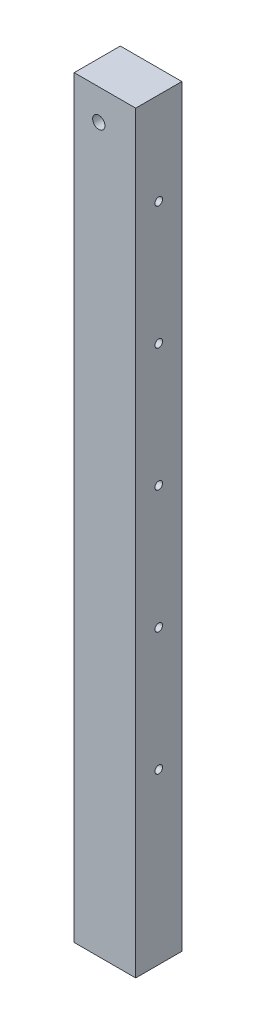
ISO-10303-21;
HEADER;
FILE_DESCRIPTION(('STEP AP214'),'2;1');
FILE_NAME('part.step','',(''),(''),'','','');
FILE_SCHEMA(('AUTOMOTIVE_DESIGN { 1 0 10303 214 1 1 1 1 }'));
ENDSEC;
DATA;
#1=APPLICATION_CONTEXT('core data for automotive mechanical design processes');
#2=APPLICATION_PROTOCOL_DEFINITION('international standard','automotive_design',2000,#1);
#3=PRODUCT_CONTEXT('',#1,'mechanical');
#4=PRODUCT('Part','Part','',(#3));
#5=PRODUCT_RELATED_PRODUCT_CATEGORY('part','',(#4));
#6=PRODUCT_DEFINITION_FORMATION('','',#4);
#7=PRODUCT_DEFINITION_CONTEXT('part definition',#1,'design');
#8=PRODUCT_DEFINITION('design','',#6,#7);
#9=PRODUCT_DEFINITION_SHAPE('','',#8);
#10=(LENGTH_UNIT() NAMED_UNIT(*) SI_UNIT(.MILLI.,.METRE.));
#11=(NAMED_UNIT(*) PLANE_ANGLE_UNIT() SI_UNIT($,.RADIAN.));
#12=(NAMED_UNIT(*) SI_UNIT($,.STERADIAN.) SOLID_ANGLE_UNIT());
#13=UNCERTAINTY_MEASURE_WITH_UNIT(LENGTH_MEASURE(1.E-05),#10,'distance_accuracy_value','');
#14=(GEOMETRIC_REPRESENTATION_CONTEXT(3) GLOBAL_UNCERTAINTY_ASSIGNED_CONTEXT((#13)) GLOBAL_UNIT_ASSIGNED_CONTEXT((#10,
#11,#12)) REPRESENTATION_CONTEXT('',''));
#15=CARTESIAN_POINT('',(0.,0.,0.));
#16=DIRECTION('',(0.,0.,1.));
#17=DIRECTION('',(1.,0.,0.));
#18=AXIS2_PLACEMENT_3D('',#15,#16,#17);
#19=CARTESIAN_POINT('',(0.,245.,0.));
#20=DIRECTION('',(1.,0.,0.));
#21=DIRECTION('',(0.,0.,-1.));
#22=AXIS2_PLACEMENT_3D('',#19,#20,#21);
#23=PLANE('',#22);
#24=CARTESIAN_POINT('',(0.,55.0000000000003,-7.49999999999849));
#25=DIRECTION('',(-1.,0.,0.));
#26=DIRECTION('',(0.,0.,1.));
#27=AXIS2_PLACEMENT_3D('',#24,#25,#26);
#28=CIRCLE('',#27,1.24999999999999);
#29=CARTESIAN_POINT('',(0.,55.0000000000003,-6.24999999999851));
#30=VERTEX_POINT('',#29);
#31=EDGE_CURVE('E136',#30,#30,#28,.T.);
#32=ORIENTED_EDGE('',*,*,#31,.F.);
#33=EDGE_LOOP('',(#32));
#34=FACE_BOUND('',#33,.T.);
#35=CARTESIAN_POINT('',(0.,95.0000000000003,-7.49999999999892));
#36=DIRECTION('',(-1.,0.,0.));
#37=DIRECTION('',(0.,0.,1.));
#38=AXIS2_PLACEMENT_3D('',#35,#36,#37);
#39=CIRCLE('',#38,1.24999999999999);
#40=CARTESIAN_POINT('',(0.,95.0000000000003,-6.24999999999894));
#41=VERTEX_POINT('',#40);
#42=EDGE_CURVE('E130',#41,#41,#39,.T.);
#43=ORIENTED_EDGE('',*,*,#42,.F.);
#44=EDGE_LOOP('',(#43));
#45=FACE_BOUND('',#44,.T.);
#46=CARTESIAN_POINT('',(0.,135.,-7.49999999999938));
#47=DIRECTION('',(-1.,0.,0.));
#48=DIRECTION('',(0.,0.,1.));
#49=AXIS2_PLACEMENT_3D('',#46,#47,#48);
#50=CIRCLE('',#49,1.25);
#51=CARTESIAN_POINT('',(0.,135.,-6.24999999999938));
#52=VERTEX_POINT('',#51);
#53=EDGE_CURVE('E124',#52,#52,#50,.T.);
#54=ORIENTED_EDGE('',*,*,#53,.F.);
#55=EDGE_LOOP('',(#54));
#56=FACE_BOUND('',#55,.T.);
#57=CARTESIAN_POINT('',(0.,175.,-7.49999999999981));
#58=DIRECTION('',(-1.,0.,0.));
#59=DIRECTION('',(0.,0.,1.));
#60=AXIS2_PLACEMENT_3D('',#57,#58,#59);
#61=CIRCLE('',#60,1.25);
#62=CARTESIAN_POINT('',(0.,175.,-6.24999999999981));
#63=VERTEX_POINT('',#62);
#64=EDGE_CURVE('E118',#63,#63,#61,.T.);
#65=ORIENTED_EDGE('',*,*,#64,.F.);
#66=EDGE_LOOP('',(#65));
#67=FACE_BOUND('',#66,.T.);
#68=CARTESIAN_POINT('',(0.,215.,-7.50000000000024));
#69=DIRECTION('',(-1.,0.,0.));
#70=DIRECTION('',(0.,0.,1.));
#71=AXIS2_PLACEMENT_3D('',#68,#69,#70);
#72=CIRCLE('',#71,1.24999999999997);
#73=CARTESIAN_POINT('',(0.,215.,-6.25000000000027));
#74=VERTEX_POINT('',#73);
#75=EDGE_CURVE('E112',#74,#74,#72,.T.);
#76=ORIENTED_EDGE('',*,*,#75,.F.);
#77=EDGE_LOOP('',(#76));
#78=FACE_BOUND('',#77,.T.);
#79=DIRECTION('',(0.,0.,1.));
#80=VECTOR('',#79,1.);
#81=CARTESIAN_POINT('',(0.,0.,0.));
#82=LINE('',#81,#80);
#83=CARTESIAN_POINT('',(0.,0.,-15.));
#84=VERTEX_POINT('',#83);
#85=CARTESIAN_POINT('',(0.,0.,0.));
#86=VERTEX_POINT('',#85);
#87=EDGE_CURVE('E96',#84,#86,#82,.T.);
#88=ORIENTED_EDGE('',*,*,#87,.T.);
#89=DIRECTION('',(0.,-1.,0.));
#90=VECTOR('',#89,1.);
#91=CARTESIAN_POINT('',(0.,245.,0.));
#92=LINE('',#91,#90);
#93=CARTESIAN_POINT('',(0.,245.,0.));
#94=VERTEX_POINT('',#93);
#95=EDGE_CURVE('E11',#94,#86,#92,.T.);
#96=ORIENTED_EDGE('',*,*,#95,.F.);
#97=DIRECTION('',(0.,0.,1.));
#98=VECTOR('',#97,1.);
#99=CARTESIAN_POINT('',(0.,245.,0.));
#100=LINE('',#99,#98);
#101=CARTESIAN_POINT('',(0.,245.,-15.));
#102=VERTEX_POINT('',#101);
#103=EDGE_CURVE('E84',#102,#94,#100,.T.);
#104=ORIENTED_EDGE('',*,*,#103,.F.);
#105=DIRECTION('',(0.,-1.,0.));
#106=VECTOR('',#105,1.);
#107=CARTESIAN_POINT('',(0.,245.,-15.));
#108=LINE('',#107,#106);
#109=EDGE_CURVE('E92',#102,#84,#108,.T.);
#110=ORIENTED_EDGE('',*,*,#109,.T.);
#111=EDGE_LOOP('',(#88,#96,#104,#110));
#112=FACE_BOUND('',#111,.T.);
#113=ADVANCED_FACE('F33',(#34,#45,#56,#67,#78,#112),#23,.F.);
#114=CARTESIAN_POINT('',(0.,245.,0.));
#115=DIRECTION('',(0.,0.,-1.));
#116=DIRECTION('',(-1.,0.,0.));
#117=AXIS2_PLACEMENT_3D('',#114,#115,#116);
#118=PLANE('',#117);
#119=CARTESIAN_POINT('',(7.9999999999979,235.,0.));
#120=DIRECTION('',(0.,0.,1.));
#121=DIRECTION('',(1.,0.,0.));
#122=AXIS2_PLACEMENT_3D('',#119,#120,#121);
#123=CIRCLE('',#122,1.99999999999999);
#124=CARTESIAN_POINT('',(9.99999999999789,235.,0.));
#125=VERTEX_POINT('',#124);
#126=EDGE_CURVE('E142',#125,#125,#123,.T.);
#127=ORIENTED_EDGE('',*,*,#126,.F.);
#128=EDGE_LOOP('',(#127));
#129=FACE_BOUND('',#128,.T.);
#130=DIRECTION('',(1.,0.,0.));
#131=VECTOR('',#130,1.);
#132=CARTESIAN_POINT('',(0.,0.,0.));
#133=LINE('',#132,#131);
#134=CARTESIAN_POINT('',(20.,0.,0.));
#135=VERTEX_POINT('',#134);
#136=EDGE_CURVE('E88',#86,#135,#133,.T.);
#137=ORIENTED_EDGE('',*,*,#136,.T.);
#138=DIRECTION('',(0.,-1.,0.));
#139=VECTOR('',#138,1.);
#140=CARTESIAN_POINT('',(20.,245.,0.));
#141=LINE('',#140,#139);
#142=CARTESIAN_POINT('',(20.,245.,0.));
#143=VERTEX_POINT('',#142);
#144=EDGE_CURVE('E41',#143,#135,#141,.T.);
#145=ORIENTED_EDGE('',*,*,#144,.F.);
#146=DIRECTION('',(1.,0.,0.));
#147=VECTOR('',#146,1.);
#148=CARTESIAN_POINT('',(0.,245.,0.));
#149=LINE('',#148,#147);
#150=EDGE_CURVE('E79',#94,#143,#149,.T.);
#151=ORIENTED_EDGE('',*,*,#150,.F.);
#152=ORIENTED_EDGE('',*,*,#95,.T.);
#153=EDGE_LOOP('',(#137,#145,#151,#152));
#154=FACE_BOUND('',#153,.T.);
#155=ADVANCED_FACE('F87',(#129,#154),#118,.F.);
#156=CARTESIAN_POINT('',(20.,245.,0.));
#157=DIRECTION('',(-1.,0.,0.));
#158=DIRECTION('',(0.,0.,1.));
#159=AXIS2_PLACEMENT_3D('',#156,#157,#158);
#160=PLANE('',#159);
#161=CARTESIAN_POINT('',(20.,55.0000000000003,-7.49999999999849));
#162=DIRECTION('',(-1.,0.,0.));
#163=DIRECTION('',(0.,0.,1.));
#164=AXIS2_PLACEMENT_3D('',#161,#162,#163);
#165=CIRCLE('',#164,1.24999999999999);
#166=CARTESIAN_POINT('',(20.,55.0000000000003,-6.2499999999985));
#167=VERTEX_POINT('',#166);
#168=EDGE_CURVE('E133',#167,#167,#165,.T.);
#169=ORIENTED_EDGE('',*,*,#168,.T.);
#170=EDGE_LOOP('',(#169));
#171=FACE_BOUND('',#170,.T.);
#172=CARTESIAN_POINT('',(20.,95.0000000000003,-7.49999999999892));
#173=DIRECTION('',(-1.,0.,0.));
#174=DIRECTION('',(0.,0.,1.));
#175=AXIS2_PLACEMENT_3D('',#172,#173,#174);
#176=CIRCLE('',#175,1.25);
#177=CARTESIAN_POINT('',(20.,95.0000000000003,-6.24999999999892));
#178=VERTEX_POINT('',#177);
#179=EDGE_CURVE('E127',#178,#178,#176,.T.);
#180=ORIENTED_EDGE('',*,*,#179,.T.);
#181=EDGE_LOOP('',(#180));
#182=FACE_BOUND('',#181,.T.);
#183=CARTESIAN_POINT('',(20.,135.,-7.49999999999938));
#184=DIRECTION('',(-1.,0.,0.));
#185=DIRECTION('',(0.,0.,1.));
#186=AXIS2_PLACEMENT_3D('',#183,#184,#185);
#187=CIRCLE('',#186,1.25);
#188=CARTESIAN_POINT('',(20.,135.,-6.24999999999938));
#189=VERTEX_POINT('',#188);
#190=EDGE_CURVE('E121',#189,#189,#187,.T.);
#191=ORIENTED_EDGE('',*,*,#190,.T.);
#192=EDGE_LOOP('',(#191));
#193=FACE_BOUND('',#192,.T.);
#194=CARTESIAN_POINT('',(20.,175.,-7.49999999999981));
#195=DIRECTION('',(-1.,0.,0.));
#196=DIRECTION('',(0.,0.,1.));
#197=AXIS2_PLACEMENT_3D('',#194,#195,#196);
#198=CIRCLE('',#197,1.25);
#199=CARTESIAN_POINT('',(20.,175.,-6.24999999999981));
#200=VERTEX_POINT('',#199);
#201=EDGE_CURVE('E115',#200,#200,#198,.T.);
#202=ORIENTED_EDGE('',*,*,#201,.T.);
#203=EDGE_LOOP('',(#202));
#204=FACE_BOUND('',#203,.T.);
#205=CARTESIAN_POINT('',(20.,215.,-7.50000000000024));
#206=DIRECTION('',(-1.,0.,0.));
#207=DIRECTION('',(0.,0.,1.));
#208=AXIS2_PLACEMENT_3D('',#205,#206,#207);
#209=CIRCLE('',#208,1.25);
#210=CARTESIAN_POINT('',(20.,215.,-6.25000000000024));
#211=VERTEX_POINT('',#210);
#212=EDGE_CURVE('E99',#211,#211,#209,.T.);
#213=ORIENTED_EDGE('',*,*,#212,.T.);
#214=EDGE_LOOP('',(#213));
#215=FACE_BOUND('',#214,.T.);
#216=DIRECTION('',(0.,0.,-1.));
#217=VECTOR('',#216,1.);
#218=CARTESIAN_POINT('',(20.,0.,0.));
#219=LINE('',#218,#217);
#220=CARTESIAN_POINT('',(20.,0.,-15.));
#221=VERTEX_POINT('',#220);
#222=EDGE_CURVE('E66',#135,#221,#219,.T.);
#223=ORIENTED_EDGE('',*,*,#222,.T.);
#224=DIRECTION('',(0.,-1.,0.));
#225=VECTOR('',#224,1.);
#226=CARTESIAN_POINT('',(20.,245.,-15.));
#227=LINE('',#226,#225);
#228=CARTESIAN_POINT('',(20.,245.,-15.));
#229=VERTEX_POINT('',#228);
#230=EDGE_CURVE('E89',#229,#221,#227,.T.);
#231=ORIENTED_EDGE('',*,*,#230,.F.);
#232=DIRECTION('',(0.,0.,-1.));
#233=VECTOR('',#232,1.);
#234=CARTESIAN_POINT('',(20.,245.,0.));
#235=LINE('',#234,#233);
#236=EDGE_CURVE('E82',#143,#229,#235,.T.);
#237=ORIENTED_EDGE('',*,*,#236,.F.);
#238=ORIENTED_EDGE('',*,*,#144,.T.);
#239=EDGE_LOOP('',(#223,#231,#237,#238));
#240=FACE_BOUND('',#239,.T.);
#241=ADVANCED_FACE('F90',(#171,#182,#193,#204,#215,#240),#160,.F.);
#242=CARTESIAN_POINT('',(0.,245.,-15.));
#243=DIRECTION('',(0.,0.,1.));
#244=DIRECTION('',(1.,0.,0.));
#245=AXIS2_PLACEMENT_3D('',#242,#243,#244);
#246=PLANE('',#245);
#247=CARTESIAN_POINT('',(7.9999999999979,235.,-15.));
#248=DIRECTION('',(0.,0.,1.));
#249=DIRECTION('',(1.,0.,0.));
#250=AXIS2_PLACEMENT_3D('',#247,#248,#249);
#251=CIRCLE('',#250,2.);
#252=CARTESIAN_POINT('',(9.9999999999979,235.,-15.));
#253=VERTEX_POINT('',#252);
#254=EDGE_CURVE('E139',#253,#253,#251,.T.);
#255=ORIENTED_EDGE('',*,*,#254,.T.);
#256=EDGE_LOOP('',(#255));
#257=FACE_BOUND('',#256,.T.);
#258=DIRECTION('',(-1.,0.,0.));
#259=VECTOR('',#258,1.);
#260=CARTESIAN_POINT('',(0.,0.,-15.));
#261=LINE('',#260,#259);
#262=EDGE_CURVE('E72',#221,#84,#261,.T.);
#263=ORIENTED_EDGE('',*,*,#262,.T.);
#264=ORIENTED_EDGE('',*,*,#109,.F.);
#265=DIRECTION('',(-1.,0.,0.));
#266=VECTOR('',#265,1.);
#267=CARTESIAN_POINT('',(0.,245.,-15.));
#268=LINE('',#267,#266);
#269=EDGE_CURVE('E49',#229,#102,#268,.T.);
#270=ORIENTED_EDGE('',*,*,#269,.F.);
#271=ORIENTED_EDGE('',*,*,#230,.T.);
#272=EDGE_LOOP('',(#263,#264,#270,#271));
#273=FACE_BOUND('',#272,.T.);
#274=ADVANCED_FACE('F104',(#257,#273),#246,.F.);
#275=CARTESIAN_POINT('',(0.,245.,0.));
#276=DIRECTION('',(0.,-1.,0.));
#277=DIRECTION('',(0.,0.,-1.));
#278=AXIS2_PLACEMENT_3D('',#275,#276,#277);
#279=PLANE('',#278);
#280=ORIENTED_EDGE('',*,*,#103,.T.);
#281=ORIENTED_EDGE('',*,*,#150,.T.);
#282=ORIENTED_EDGE('',*,*,#236,.T.);
#283=ORIENTED_EDGE('',*,*,#269,.T.);
#284=EDGE_LOOP('',(#280,#281,#282,#283));
#285=FACE_BOUND('',#284,.T.);
#286=ADVANCED_FACE('F80',(#285),#279,.F.);
#287=CARTESIAN_POINT('',(0.,0.,0.));
#288=DIRECTION('',(0.,-1.,0.));
#289=DIRECTION('',(0.,0.,-1.));
#290=AXIS2_PLACEMENT_3D('',#287,#288,#289);
#291=PLANE('',#290);
#292=ORIENTED_EDGE('',*,*,#87,.F.);
#293=ORIENTED_EDGE('',*,*,#262,.F.);
#294=ORIENTED_EDGE('',*,*,#222,.F.);
#295=ORIENTED_EDGE('',*,*,#136,.F.);
#296=EDGE_LOOP('',(#292,#293,#294,#295));
#297=FACE_BOUND('',#296,.T.);
#298=ADVANCED_FACE('F107',(#297),#291,.T.);
#299=CARTESIAN_POINT('',(0.,215.,-7.50000000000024));
#300=DIRECTION('',(-1.,0.,0.));
#301=DIRECTION('',(0.,0.,1.));
#302=AXIS2_PLACEMENT_3D('',#299,#300,#301);
#303=CYLINDRICAL_SURFACE('',#302,1.24999999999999);
#304=ORIENTED_EDGE('',*,*,#212,.F.);
#305=EDGE_LOOP('',(#304));
#306=FACE_BOUND('',#305,.T.);
#307=ORIENTED_EDGE('',*,*,#75,.T.);
#308=EDGE_LOOP('',(#307));
#309=FACE_BOUND('',#308,.T.);
#310=ADVANCED_FACE('F163',(#306,#309),#303,.F.);
#311=CARTESIAN_POINT('',(0.,175.,-7.49999999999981));
#312=DIRECTION('',(-1.,0.,0.));
#313=DIRECTION('',(0.,0.,1.));
#314=AXIS2_PLACEMENT_3D('',#311,#312,#313);
#315=CYLINDRICAL_SURFACE('',#314,1.25);
#316=ORIENTED_EDGE('',*,*,#201,.F.);
#317=EDGE_LOOP('',(#316));
#318=FACE_BOUND('',#317,.T.);
#319=ORIENTED_EDGE('',*,*,#64,.T.);
#320=EDGE_LOOP('',(#319));
#321=FACE_BOUND('',#320,.T.);
#322=ADVANCED_FACE('F168',(#318,#321),#315,.F.);
#323=CARTESIAN_POINT('',(0.,135.,-7.49999999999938));
#324=DIRECTION('',(-1.,0.,0.));
#325=DIRECTION('',(0.,0.,1.));
#326=AXIS2_PLACEMENT_3D('',#323,#324,#325);
#327=CYLINDRICAL_SURFACE('',#326,1.25);
#328=ORIENTED_EDGE('',*,*,#190,.F.);
#329=EDGE_LOOP('',(#328));
#330=FACE_BOUND('',#329,.T.);
#331=ORIENTED_EDGE('',*,*,#53,.T.);
#332=EDGE_LOOP('',(#331));
#333=FACE_BOUND('',#332,.T.);
#334=ADVANCED_FACE('F172',(#330,#333),#327,.F.);
#335=CARTESIAN_POINT('',(0.,95.0000000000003,-7.49999999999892));
#336=DIRECTION('',(-1.,0.,0.));
#337=DIRECTION('',(0.,0.,1.));
#338=AXIS2_PLACEMENT_3D('',#335,#336,#337);
#339=CYLINDRICAL_SURFACE('',#338,1.24999999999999);
#340=ORIENTED_EDGE('',*,*,#179,.F.);
#341=EDGE_LOOP('',(#340));
#342=FACE_BOUND('',#341,.T.);
#343=ORIENTED_EDGE('',*,*,#42,.T.);
#344=EDGE_LOOP('',(#343));
#345=FACE_BOUND('',#344,.T.);
#346=ADVANCED_FACE('F176',(#342,#345),#339,.F.);
#347=CARTESIAN_POINT('',(0.,55.0000000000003,-7.49999999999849));
#348=DIRECTION('',(-1.,0.,0.));
#349=DIRECTION('',(0.,0.,1.));
#350=AXIS2_PLACEMENT_3D('',#347,#348,#349);
#351=CYLINDRICAL_SURFACE('',#350,1.24999999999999);
#352=ORIENTED_EDGE('',*,*,#168,.F.);
#353=EDGE_LOOP('',(#352));
#354=FACE_BOUND('',#353,.T.);
#355=ORIENTED_EDGE('',*,*,#31,.T.);
#356=EDGE_LOOP('',(#355));
#357=FACE_BOUND('',#356,.T.);
#358=ADVANCED_FACE('F180',(#354,#357),#351,.F.);
#359=CARTESIAN_POINT('',(7.9999999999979,235.,0.));
#360=DIRECTION('',(0.,0.,1.));
#361=DIRECTION('',(1.,0.,0.));
#362=AXIS2_PLACEMENT_3D('',#359,#360,#361);
#363=CYLINDRICAL_SURFACE('',#362,1.99999999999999);
#364=ORIENTED_EDGE('',*,*,#254,.F.);
#365=EDGE_LOOP('',(#364));
#366=FACE_BOUND('',#365,.T.);
#367=ORIENTED_EDGE('',*,*,#126,.T.);
#368=EDGE_LOOP('',(#367));
#369=FACE_BOUND('',#368,.T.);
#370=ADVANCED_FACE('F146',(#366,#369),#363,.F.);
#371=CLOSED_SHELL('',(#113,#155,#241,#274,#286,#298,#310,#322,#334,#346,#358,#370));
#372=MANIFOLD_SOLID_BREP('B2',#371);
#373=ADVANCED_BREP_SHAPE_REPRESENTATION('',(#18,#372),#14);
#374=SHAPE_DEFINITION_REPRESENTATION(#9,#373);
ENDSEC;
END-ISO-10303-21;
